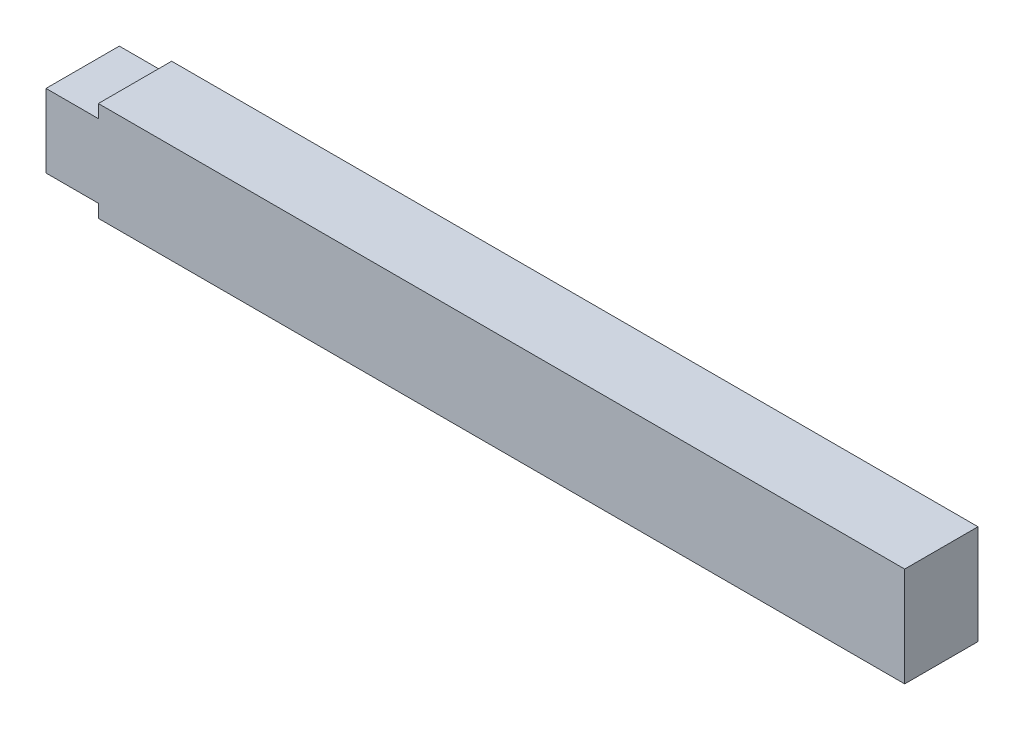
ISO-10303-21;
HEADER;
FILE_DESCRIPTION(('STEP AP214'),'2;1');
FILE_NAME('part.step','',(''),(''),'','','');
FILE_SCHEMA(('AUTOMOTIVE_DESIGN { 1 0 10303 214 1 1 1 1 }'));
ENDSEC;
DATA;
#1=APPLICATION_CONTEXT('core data for automotive mechanical design processes');
#2=APPLICATION_PROTOCOL_DEFINITION('international standard','automotive_design',2000,#1);
#3=PRODUCT_CONTEXT('',#1,'mechanical');
#4=PRODUCT('Part','Part','',(#3));
#5=PRODUCT_RELATED_PRODUCT_CATEGORY('part','',(#4));
#6=PRODUCT_DEFINITION_FORMATION('','',#4);
#7=PRODUCT_DEFINITION_CONTEXT('part definition',#1,'design');
#8=PRODUCT_DEFINITION('design','',#6,#7);
#9=PRODUCT_DEFINITION_SHAPE('','',#8);
#10=(LENGTH_UNIT() NAMED_UNIT(*) SI_UNIT(.MILLI.,.METRE.));
#11=(NAMED_UNIT(*) PLANE_ANGLE_UNIT() SI_UNIT($,.RADIAN.));
#12=(NAMED_UNIT(*) SI_UNIT($,.STERADIAN.) SOLID_ANGLE_UNIT());
#13=UNCERTAINTY_MEASURE_WITH_UNIT(LENGTH_MEASURE(1.E-05),#10,'distance_accuracy_value','');
#14=(GEOMETRIC_REPRESENTATION_CONTEXT(3) GLOBAL_UNCERTAINTY_ASSIGNED_CONTEXT((#13)) GLOBAL_UNIT_ASSIGNED_CONTEXT((#10,
#11,#12)) REPRESENTATION_CONTEXT('',''));
#15=CARTESIAN_POINT('',(0.,0.,0.));
#16=DIRECTION('',(0.,0.,1.));
#17=DIRECTION('',(1.,0.,0.));
#18=AXIS2_PLACEMENT_3D('',#15,#16,#17);
#19=CARTESIAN_POINT('',(-20.,50.,50.));
#20=DIRECTION('',(1.,0.,0.));
#21=DIRECTION('',(0.,1.,0.));
#22=AXIS2_PLACEMENT_3D('',#19,#20,#21);
#23=PLANE('',#22);
#24=DIRECTION('',(0.,-1.,0.));
#25=VECTOR('',#24,1.);
#26=CARTESIAN_POINT('',(-20.,75.,-70.));
#27=LINE('',#26,#25);
#28=CARTESIAN_POINT('',(-20.,95.,-70.));
#29=VERTEX_POINT('',#28);
#30=CARTESIAN_POINT('',(-20.,70.,-70.));
#31=VERTEX_POINT('',#30);
#32=EDGE_CURVE('E192',#29,#31,#27,.T.);
#33=ORIENTED_EDGE('',*,*,#32,.T.);
#34=DIRECTION('',(0.,0.,-1.));
#35=VECTOR('',#34,1.);
#36=CARTESIAN_POINT('',(-20.,70.,50.));
#37=LINE('',#36,#35);
#38=CARTESIAN_POINT('',(-20.,70.,70.));
#39=VERTEX_POINT('',#38);
#40=EDGE_CURVE('E186',#39,#31,#37,.T.);
#41=ORIENTED_EDGE('',*,*,#40,.F.);
#42=DIRECTION('',(0.,-1.,0.));
#43=VECTOR('',#42,1.);
#44=CARTESIAN_POINT('',(-20.,75.,70.));
#45=LINE('',#44,#43);
#46=CARTESIAN_POINT('',(-20.,95.,70.));
#47=VERTEX_POINT('',#46);
#48=EDGE_CURVE('E234',#47,#39,#45,.T.);
#49=ORIENTED_EDGE('',*,*,#48,.F.);
#50=DIRECTION('',(0.,0.,-1.));
#51=VECTOR('',#50,1.);
#52=CARTESIAN_POINT('',(-20.,95.,50.));
#53=LINE('',#52,#51);
#54=EDGE_CURVE('E231',#47,#29,#53,.T.);
#55=ORIENTED_EDGE('',*,*,#54,.T.);
#56=EDGE_LOOP('',(#33,#41,#49,#55));
#57=FACE_BOUND('',#56,.T.);
#58=ADVANCED_FACE('F39',(#57),#23,.F.);
#59=CARTESIAN_POINT('',(0.,70.,50.));
#60=DIRECTION('',(0.,-1.,0.));
#61=DIRECTION('',(0.,0.,-1.));
#62=AXIS2_PLACEMENT_3D('',#59,#60,#61);
#63=PLANE('',#62);
#64=DIRECTION('',(-1.,0.,0.));
#65=VECTOR('',#64,1.);
#66=CARTESIAN_POINT('',(0.,70.,-70.));
#67=LINE('',#66,#65);
#68=CARTESIAN_POINT('',(-120.,70.,-70.));
#69=VERTEX_POINT('',#68);
#70=EDGE_CURVE('E180',#31,#69,#67,.T.);
#71=ORIENTED_EDGE('',*,*,#70,.T.);
#72=DIRECTION('',(0.,0.,-1.));
#73=VECTOR('',#72,1.);
#74=CARTESIAN_POINT('',(-120.,70.,50.));
#75=LINE('',#74,#73);
#76=CARTESIAN_POINT('',(-120.,70.,70.));
#77=VERTEX_POINT('',#76);
#78=EDGE_CURVE('E183',#77,#69,#75,.T.);
#79=ORIENTED_EDGE('',*,*,#78,.F.);
#80=DIRECTION('',(-1.,0.,0.));
#81=VECTOR('',#80,1.);
#82=CARTESIAN_POINT('',(0.,70.,70.));
#83=LINE('',#82,#81);
#84=EDGE_CURVE('E210',#39,#77,#83,.T.);
#85=ORIENTED_EDGE('',*,*,#84,.F.);
#86=ORIENTED_EDGE('',*,*,#40,.T.);
#87=EDGE_LOOP('',(#71,#79,#85,#86));
#88=FACE_BOUND('',#87,.T.);
#89=ADVANCED_FACE('F182',(#88),#63,.F.);
#90=CARTESIAN_POINT('',(-120.,50.,50.));
#91=DIRECTION('',(1.,0.,0.));
#92=DIRECTION('',(0.,0.,-1.));
#93=AXIS2_PLACEMENT_3D('',#90,#91,#92);
#94=PLANE('',#93);
#95=DIRECTION('',(0.,-1.,0.));
#96=VECTOR('',#95,1.);
#97=CARTESIAN_POINT('',(-120.,75.,-70.));
#98=LINE('',#97,#96);
#99=CARTESIAN_POINT('',(-120.,-70.,-70.));
#100=VERTEX_POINT('',#99);
#101=EDGE_CURVE('E191',#69,#100,#98,.T.);
#102=ORIENTED_EDGE('',*,*,#101,.T.);
#103=DIRECTION('',(0.,0.,-1.));
#104=VECTOR('',#103,1.);
#105=CARTESIAN_POINT('',(-120.,-70.,50.));
#106=LINE('',#105,#104);
#107=CARTESIAN_POINT('',(-120.,-70.,70.));
#108=VERTEX_POINT('',#107);
#109=EDGE_CURVE('E199',#108,#100,#106,.T.);
#110=ORIENTED_EDGE('',*,*,#109,.F.);
#111=DIRECTION('',(0.,-1.,0.));
#112=VECTOR('',#111,1.);
#113=CARTESIAN_POINT('',(-120.,75.,70.));
#114=LINE('',#113,#112);
#115=EDGE_CURVE('E198',#77,#108,#114,.T.);
#116=ORIENTED_EDGE('',*,*,#115,.F.);
#117=ORIENTED_EDGE('',*,*,#78,.T.);
#118=EDGE_LOOP('',(#102,#110,#116,#117));
#119=FACE_BOUND('',#118,.T.);
#120=ADVANCED_FACE('F195',(#119),#94,.F.);
#121=CARTESIAN_POINT('',(-100.,-70.,50.));
#122=DIRECTION('',(0.,1.,0.));
#123=DIRECTION('',(-1.,0.,0.));
#124=AXIS2_PLACEMENT_3D('',#121,#122,#123);
#125=PLANE('',#124);
#126=DIRECTION('',(1.,0.,0.));
#127=VECTOR('',#126,1.);
#128=CARTESIAN_POINT('',(0.,-70.,-70.));
#129=LINE('',#128,#127);
#130=CARTESIAN_POINT('',(-20.,-70.,-70.));
#131=VERTEX_POINT('',#130);
#132=EDGE_CURVE('E204',#100,#131,#129,.T.);
#133=ORIENTED_EDGE('',*,*,#132,.T.);
#134=DIRECTION('',(0.,0.,-1.));
#135=VECTOR('',#134,1.);
#136=CARTESIAN_POINT('',(-20.,-70.,50.));
#137=LINE('',#136,#135);
#138=CARTESIAN_POINT('',(-20.,-70.,70.));
#139=VERTEX_POINT('',#138);
#140=EDGE_CURVE('E212',#139,#131,#137,.T.);
#141=ORIENTED_EDGE('',*,*,#140,.F.);
#142=DIRECTION('',(1.,0.,0.));
#143=VECTOR('',#142,1.);
#144=CARTESIAN_POINT('',(0.,-70.,70.));
#145=LINE('',#144,#143);
#146=EDGE_CURVE('E213',#108,#139,#145,.T.);
#147=ORIENTED_EDGE('',*,*,#146,.F.);
#148=ORIENTED_EDGE('',*,*,#109,.T.);
#149=EDGE_LOOP('',(#133,#141,#147,#148));
#150=FACE_BOUND('',#149,.T.);
#151=ADVANCED_FACE('F301',(#150),#125,.F.);
#152=CARTESIAN_POINT('',(-20.,-50.,50.));
#153=DIRECTION('',(1.,0.,0.));
#154=DIRECTION('',(0.,0.,-1.));
#155=AXIS2_PLACEMENT_3D('',#152,#153,#154);
#156=PLANE('',#155);
#157=DIRECTION('',(0.,-1.,0.));
#158=VECTOR('',#157,1.);
#159=CARTESIAN_POINT('',(-20.,75.,-70.));
#160=LINE('',#159,#158);
#161=CARTESIAN_POINT('',(-20.,-95.,-70.));
#162=VERTEX_POINT('',#161);
#163=EDGE_CURVE('E206',#131,#162,#160,.T.);
#164=ORIENTED_EDGE('',*,*,#163,.T.);
#165=DIRECTION('',(0.,0.,-1.));
#166=VECTOR('',#165,1.);
#167=CARTESIAN_POINT('',(-20.,-95.,50.));
#168=LINE('',#167,#166);
#169=CARTESIAN_POINT('',(-20.,-95.,70.));
#170=VERTEX_POINT('',#169);
#171=EDGE_CURVE('E217',#170,#162,#168,.T.);
#172=ORIENTED_EDGE('',*,*,#171,.F.);
#173=DIRECTION('',(0.,-1.,0.));
#174=VECTOR('',#173,1.);
#175=CARTESIAN_POINT('',(-20.,75.,70.));
#176=LINE('',#175,#174);
#177=EDGE_CURVE('E219',#139,#170,#176,.T.);
#178=ORIENTED_EDGE('',*,*,#177,.F.);
#179=ORIENTED_EDGE('',*,*,#140,.T.);
#180=EDGE_LOOP('',(#164,#172,#178,#179));
#181=FACE_BOUND('',#180,.T.);
#182=ADVANCED_FACE('F293',(#181),#156,.F.);
#183=CARTESIAN_POINT('',(1500.,-94.9999999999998,50.));
#184=DIRECTION('',(0.,1.,0.));
#185=DIRECTION('',(-1.,0.,0.));
#186=AXIS2_PLACEMENT_3D('',#183,#184,#185);
#187=PLANE('',#186);
#188=DIRECTION('',(1.,0.,0.));
#189=VECTOR('',#188,1.);
#190=CARTESIAN_POINT('',(0.,-95.,-70.));
#191=LINE('',#190,#189);
#192=CARTESIAN_POINT('',(1520.,-94.9999999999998,-70.));
#193=VERTEX_POINT('',#192);
#194=EDGE_CURVE('E152',#162,#193,#191,.T.);
#195=ORIENTED_EDGE('',*,*,#194,.T.);
#196=DIRECTION('',(0.,0.,-1.));
#197=VECTOR('',#196,1.);
#198=CARTESIAN_POINT('',(1520.,-94.9999999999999,50.));
#199=LINE('',#198,#197);
#200=CARTESIAN_POINT('',(1520.,-94.9999999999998,70.));
#201=VERTEX_POINT('',#200);
#202=EDGE_CURVE('E222',#201,#193,#199,.T.);
#203=ORIENTED_EDGE('',*,*,#202,.F.);
#204=DIRECTION('',(1.,0.,0.));
#205=VECTOR('',#204,1.);
#206=CARTESIAN_POINT('',(0.,-95.,70.));
#207=LINE('',#206,#205);
#208=EDGE_CURVE('E224',#170,#201,#207,.T.);
#209=ORIENTED_EDGE('',*,*,#208,.F.);
#210=ORIENTED_EDGE('',*,*,#171,.T.);
#211=EDGE_LOOP('',(#195,#203,#209,#210));
#212=FACE_BOUND('',#211,.T.);
#213=ADVANCED_FACE('F297',(#212),#187,.F.);
#214=CARTESIAN_POINT('',(1520.,75.,50.));
#215=DIRECTION('',(-1.,0.,0.));
#216=DIRECTION('',(0.,0.,1.));
#217=AXIS2_PLACEMENT_3D('',#214,#215,#216);
#218=PLANE('',#217);
#219=DIRECTION('',(0.,1.,0.));
#220=VECTOR('',#219,1.);
#221=CARTESIAN_POINT('',(1520.,75.,-70.));
#222=LINE('',#221,#220);
#223=CARTESIAN_POINT('',(1520.,95.,-70.));
#224=VERTEX_POINT('',#223);
#225=EDGE_CURVE('E144',#193,#224,#222,.T.);
#226=ORIENTED_EDGE('',*,*,#225,.T.);
#227=DIRECTION('',(0.,0.,-1.));
#228=VECTOR('',#227,1.);
#229=CARTESIAN_POINT('',(1520.,95.,50.));
#230=LINE('',#229,#228);
#231=CARTESIAN_POINT('',(1520.,95.,70.));
#232=VERTEX_POINT('',#231);
#233=EDGE_CURVE('E227',#232,#224,#230,.T.);
#234=ORIENTED_EDGE('',*,*,#233,.F.);
#235=DIRECTION('',(0.,1.,0.));
#236=VECTOR('',#235,1.);
#237=CARTESIAN_POINT('',(1520.,75.,70.));
#238=LINE('',#237,#236);
#239=EDGE_CURVE('E122',#201,#232,#238,.T.);
#240=ORIENTED_EDGE('',*,*,#239,.F.);
#241=ORIENTED_EDGE('',*,*,#202,.T.);
#242=EDGE_LOOP('',(#226,#234,#240,#241));
#243=FACE_BOUND('',#242,.T.);
#244=ADVANCED_FACE('F342',(#243),#218,.F.);
#245=CARTESIAN_POINT('',(0.,95.,50.));
#246=DIRECTION('',(0.,-1.,0.));
#247=DIRECTION('',(0.,0.,-1.));
#248=AXIS2_PLACEMENT_3D('',#245,#246,#247);
#249=PLANE('',#248);
#250=DIRECTION('',(-1.,0.,0.));
#251=VECTOR('',#250,1.);
#252=CARTESIAN_POINT('',(0.,95.,-70.));
#253=LINE('',#252,#251);
#254=EDGE_CURVE('E134',#224,#29,#253,.T.);
#255=ORIENTED_EDGE('',*,*,#254,.T.);
#256=ORIENTED_EDGE('',*,*,#54,.F.);
#257=DIRECTION('',(-1.,0.,0.));
#258=VECTOR('',#257,1.);
#259=CARTESIAN_POINT('',(0.,95.,70.));
#260=LINE('',#259,#258);
#261=EDGE_CURVE('E116',#232,#47,#260,.T.);
#262=ORIENTED_EDGE('',*,*,#261,.F.);
#263=ORIENTED_EDGE('',*,*,#233,.T.);
#264=EDGE_LOOP('',(#255,#256,#262,#263));
#265=FACE_BOUND('',#264,.T.);
#266=ADVANCED_FACE('F351',(#265),#249,.F.);
#267=CARTESIAN_POINT('',(0.,75.,70.));
#268=DIRECTION('',(0.,0.,-1.));
#269=DIRECTION('',(-1.,0.,0.));
#270=AXIS2_PLACEMENT_3D('',#267,#268,#269);
#271=PLANE('',#270);
#272=ORIENTED_EDGE('',*,*,#48,.T.);
#273=ORIENTED_EDGE('',*,*,#84,.T.);
#274=ORIENTED_EDGE('',*,*,#115,.T.);
#275=ORIENTED_EDGE('',*,*,#146,.T.);
#276=ORIENTED_EDGE('',*,*,#177,.T.);
#277=ORIENTED_EDGE('',*,*,#208,.T.);
#278=ORIENTED_EDGE('',*,*,#239,.T.);
#279=ORIENTED_EDGE('',*,*,#261,.T.);
#280=EDGE_LOOP('',(#272,#273,#274,#275,#276,#277,#278,#279));
#281=FACE_BOUND('',#280,.T.);
#282=ADVANCED_FACE('F298',(#281),#271,.F.);
#283=CARTESIAN_POINT('',(0.,75.,-70.));
#284=DIRECTION('',(0.,0.,-1.));
#285=DIRECTION('',(-1.,0.,0.));
#286=AXIS2_PLACEMENT_3D('',#283,#284,#285);
#287=PLANE('',#286);
#288=ORIENTED_EDGE('',*,*,#32,.F.);
#289=ORIENTED_EDGE('',*,*,#254,.F.);
#290=ORIENTED_EDGE('',*,*,#225,.F.);
#291=ORIENTED_EDGE('',*,*,#194,.F.);
#292=ORIENTED_EDGE('',*,*,#163,.F.);
#293=ORIENTED_EDGE('',*,*,#132,.F.);
#294=ORIENTED_EDGE('',*,*,#101,.F.);
#295=ORIENTED_EDGE('',*,*,#70,.F.);
#296=EDGE_LOOP('',(#288,#289,#290,#291,#292,#293,#294,#295));
#297=FACE_BOUND('',#296,.T.);
#298=ADVANCED_FACE('F202',(#297),#287,.T.);
#299=CLOSED_SHELL('',(#58,#89,#120,#151,#182,#213,#244,#266,#282,#298));
#300=CARTESIAN_POINT('',(0.,50.,50.));
#301=DIRECTION('',(1.,0.,0.));
#302=DIRECTION('',(0.,1.,0.));
#303=AXIS2_PLACEMENT_3D('',#300,#301,#302);
#304=PLANE('',#303);
#305=DIRECTION('',(0.,-1.,0.));
#306=VECTOR('',#305,1.);
#307=CARTESIAN_POINT('',(0.,50.,-50.));
#308=LINE('',#307,#306);
#309=CARTESIAN_POINT('',(0.,75.,-50.));
#310=VERTEX_POINT('',#309);
#311=CARTESIAN_POINT('',(0.,50.,-50.));
#312=VERTEX_POINT('',#311);
#313=EDGE_CURVE('E43',#310,#312,#308,.T.);
#314=ORIENTED_EDGE('',*,*,#313,.F.);
#315=DIRECTION('',(0.,0.,-1.));
#316=VECTOR('',#315,1.);
#317=CARTESIAN_POINT('',(0.,75.,50.));
#318=LINE('',#317,#316);
#319=CARTESIAN_POINT('',(0.,75.,50.));
#320=VERTEX_POINT('',#319);
#321=EDGE_CURVE('E279',#320,#310,#318,.T.);
#322=ORIENTED_EDGE('',*,*,#321,.F.);
#323=DIRECTION('',(0.,-1.,0.));
#324=VECTOR('',#323,1.);
#325=CARTESIAN_POINT('',(0.,50.,50.));
#326=LINE('',#325,#324);
#327=CARTESIAN_POINT('',(0.,50.,50.));
#328=VERTEX_POINT('',#327);
#329=EDGE_CURVE('E246',#320,#328,#326,.T.);
#330=ORIENTED_EDGE('',*,*,#329,.T.);
#331=DIRECTION('',(0.,0.,-1.));
#332=VECTOR('',#331,1.);
#333=CARTESIAN_POINT('',(0.,50.,50.));
#334=LINE('',#333,#332);
#335=EDGE_CURVE('E277',#328,#312,#334,.T.);
#336=ORIENTED_EDGE('',*,*,#335,.T.);
#337=EDGE_LOOP('',(#314,#322,#330,#336));
#338=FACE_BOUND('',#337,.T.);
#339=ADVANCED_FACE('F383',(#338),#304,.T.);
#340=CARTESIAN_POINT('',(0.,50.,50.));
#341=DIRECTION('',(0.,-1.,0.));
#342=DIRECTION('',(0.,0.,-1.));
#343=AXIS2_PLACEMENT_3D('',#340,#341,#342);
#344=PLANE('',#343);
#345=DIRECTION('',(-1.,0.,0.));
#346=VECTOR('',#345,1.);
#347=CARTESIAN_POINT('',(0.,50.,-50.));
#348=LINE('',#347,#346);
#349=CARTESIAN_POINT('',(-100.,50.,-50.));
#350=VERTEX_POINT('',#349);
#351=EDGE_CURVE('E59',#312,#350,#348,.T.);
#352=ORIENTED_EDGE('',*,*,#351,.F.);
#353=ORIENTED_EDGE('',*,*,#335,.F.);
#354=DIRECTION('',(-1.,0.,0.));
#355=VECTOR('',#354,1.);
#356=CARTESIAN_POINT('',(0.,50.,50.));
#357=LINE('',#356,#355);
#358=CARTESIAN_POINT('',(-100.,50.,50.));
#359=VERTEX_POINT('',#358);
#360=EDGE_CURVE('E106',#328,#359,#357,.T.);
#361=ORIENTED_EDGE('',*,*,#360,.T.);
#362=DIRECTION('',(0.,0.,-1.));
#363=VECTOR('',#362,1.);
#364=CARTESIAN_POINT('',(-100.,50.,50.));
#365=LINE('',#364,#363);
#366=EDGE_CURVE('E273',#359,#350,#365,.T.);
#367=ORIENTED_EDGE('',*,*,#366,.T.);
#368=EDGE_LOOP('',(#352,#353,#361,#367));
#369=FACE_BOUND('',#368,.T.);
#370=ADVANCED_FACE('F388',(#369),#344,.T.);
#371=CARTESIAN_POINT('',(-100.,50.,50.));
#372=DIRECTION('',(1.,0.,0.));
#373=DIRECTION('',(0.,0.,-1.));
#374=AXIS2_PLACEMENT_3D('',#371,#372,#373);
#375=PLANE('',#374);
#376=DIRECTION('',(0.,-1.,0.));
#377=VECTOR('',#376,1.);
#378=CARTESIAN_POINT('',(-100.,50.,-50.));
#379=LINE('',#378,#377);
#380=CARTESIAN_POINT('',(-100.,-50.,-50.));
#381=VERTEX_POINT('',#380);
#382=EDGE_CURVE('E275',#350,#381,#379,.T.);
#383=ORIENTED_EDGE('',*,*,#382,.F.);
#384=ORIENTED_EDGE('',*,*,#366,.F.);
#385=DIRECTION('',(0.,-1.,0.));
#386=VECTOR('',#385,1.);
#387=CARTESIAN_POINT('',(-100.,50.,50.));
#388=LINE('',#387,#386);
#389=CARTESIAN_POINT('',(-100.,-50.,50.));
#390=VERTEX_POINT('',#389);
#391=EDGE_CURVE('E243',#359,#390,#388,.T.);
#392=ORIENTED_EDGE('',*,*,#391,.T.);
#393=DIRECTION('',(0.,0.,-1.));
#394=VECTOR('',#393,1.);
#395=CARTESIAN_POINT('',(-100.,-50.,50.));
#396=LINE('',#395,#394);
#397=EDGE_CURVE('E268',#390,#381,#396,.T.);
#398=ORIENTED_EDGE('',*,*,#397,.T.);
#399=EDGE_LOOP('',(#383,#384,#392,#398));
#400=FACE_BOUND('',#399,.T.);
#401=ADVANCED_FACE('F401',(#400),#375,.T.);
#402=CARTESIAN_POINT('',(-100.,-50.,50.));
#403=DIRECTION('',(0.,1.,0.));
#404=DIRECTION('',(-1.,0.,0.));
#405=AXIS2_PLACEMENT_3D('',#402,#403,#404);
#406=PLANE('',#405);
#407=DIRECTION('',(1.,0.,0.));
#408=VECTOR('',#407,1.);
#409=CARTESIAN_POINT('',(-100.,-50.,-50.));
#410=LINE('',#409,#408);
#411=CARTESIAN_POINT('',(0.,-50.,-50.));
#412=VERTEX_POINT('',#411);
#413=EDGE_CURVE('E271',#381,#412,#410,.T.);
#414=ORIENTED_EDGE('',*,*,#413,.F.);
#415=ORIENTED_EDGE('',*,*,#397,.F.);
#416=DIRECTION('',(1.,0.,0.));
#417=VECTOR('',#416,1.);
#418=CARTESIAN_POINT('',(-100.,-50.,50.));
#419=LINE('',#418,#417);
#420=CARTESIAN_POINT('',(0.,-50.,50.));
#421=VERTEX_POINT('',#420);
#422=EDGE_CURVE('E241',#390,#421,#419,.T.);
#423=ORIENTED_EDGE('',*,*,#422,.T.);
#424=DIRECTION('',(0.,0.,-1.));
#425=VECTOR('',#424,1.);
#426=CARTESIAN_POINT('',(0.,-50.,50.));
#427=LINE('',#426,#425);
#428=EDGE_CURVE('E263',#421,#412,#427,.T.);
#429=ORIENTED_EDGE('',*,*,#428,.T.);
#430=EDGE_LOOP('',(#414,#415,#423,#429));
#431=FACE_BOUND('',#430,.T.);
#432=ADVANCED_FACE('F411',(#431),#406,.T.);
#433=CARTESIAN_POINT('',(0.,-50.,50.));
#434=DIRECTION('',(1.,0.,0.));
#435=DIRECTION('',(0.,0.,-1.));
#436=AXIS2_PLACEMENT_3D('',#433,#434,#435);
#437=PLANE('',#436);
#438=DIRECTION('',(0.,-1.,0.));
#439=VECTOR('',#438,1.);
#440=CARTESIAN_POINT('',(0.,-50.,-50.));
#441=LINE('',#440,#439);
#442=CARTESIAN_POINT('',(0.,-75.,-50.));
#443=VERTEX_POINT('',#442);
#444=EDGE_CURVE('E266',#412,#443,#441,.T.);
#445=ORIENTED_EDGE('',*,*,#444,.F.);
#446=ORIENTED_EDGE('',*,*,#428,.F.);
#447=DIRECTION('',(0.,-1.,0.));
#448=VECTOR('',#447,1.);
#449=CARTESIAN_POINT('',(0.,-50.,50.));
#450=LINE('',#449,#448);
#451=CARTESIAN_POINT('',(0.,-75.,50.));
#452=VERTEX_POINT('',#451);
#453=EDGE_CURVE('E239',#421,#452,#450,.T.);
#454=ORIENTED_EDGE('',*,*,#453,.T.);
#455=DIRECTION('',(0.,0.,-1.));
#456=VECTOR('',#455,1.);
#457=CARTESIAN_POINT('',(0.,-75.,50.));
#458=LINE('',#457,#456);
#459=EDGE_CURVE('E258',#452,#443,#458,.T.);
#460=ORIENTED_EDGE('',*,*,#459,.T.);
#461=EDGE_LOOP('',(#445,#446,#454,#460));
#462=FACE_BOUND('',#461,.T.);
#463=ADVANCED_FACE('F422',(#462),#437,.T.);
#464=CARTESIAN_POINT('',(1500.,-74.9999999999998,50.));
#465=DIRECTION('',(0.,1.,0.));
#466=DIRECTION('',(-1.,0.,0.));
#467=AXIS2_PLACEMENT_3D('',#464,#465,#466);
#468=PLANE('',#467);
#469=DIRECTION('',(1.,0.,0.));
#470=VECTOR('',#469,1.);
#471=CARTESIAN_POINT('',(1500.,-74.9999999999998,-50.));
#472=LINE('',#471,#470);
#473=CARTESIAN_POINT('',(1500.,-74.9999999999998,-50.));
#474=VERTEX_POINT('',#473);
#475=EDGE_CURVE('E261',#443,#474,#472,.T.);
#476=ORIENTED_EDGE('',*,*,#475,.F.);
#477=ORIENTED_EDGE('',*,*,#459,.F.);
#478=DIRECTION('',(1.,0.,0.));
#479=VECTOR('',#478,1.);
#480=CARTESIAN_POINT('',(1500.,-74.9999999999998,50.));
#481=LINE('',#480,#479);
#482=CARTESIAN_POINT('',(1500.,-74.9999999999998,50.));
#483=VERTEX_POINT('',#482);
#484=EDGE_CURVE('E237',#452,#483,#481,.T.);
#485=ORIENTED_EDGE('',*,*,#484,.T.);
#486=DIRECTION('',(0.,0.,-1.));
#487=VECTOR('',#486,1.);
#488=CARTESIAN_POINT('',(1500.,-74.9999999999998,50.));
#489=LINE('',#488,#487);
#490=EDGE_CURVE('E253',#483,#474,#489,.T.);
#491=ORIENTED_EDGE('',*,*,#490,.T.);
#492=EDGE_LOOP('',(#476,#477,#485,#491));
#493=FACE_BOUND('',#492,.T.);
#494=ADVANCED_FACE('F433',(#493),#468,.T.);
#495=CARTESIAN_POINT('',(1500.,75.,50.));
#496=DIRECTION('',(-1.,0.,0.));
#497=DIRECTION('',(0.,0.,1.));
#498=AXIS2_PLACEMENT_3D('',#495,#496,#497);
#499=PLANE('',#498);
#500=DIRECTION('',(0.,1.,0.));
#501=VECTOR('',#500,1.);
#502=CARTESIAN_POINT('',(1500.,75.,-50.));
#503=LINE('',#502,#501);
#504=CARTESIAN_POINT('',(1500.,75.,-50.));
#505=VERTEX_POINT('',#504);
#506=EDGE_CURVE('E256',#474,#505,#503,.T.);
#507=ORIENTED_EDGE('',*,*,#506,.F.);
#508=ORIENTED_EDGE('',*,*,#490,.F.);
#509=DIRECTION('',(0.,1.,0.));
#510=VECTOR('',#509,1.);
#511=CARTESIAN_POINT('',(1500.,75.,50.));
#512=LINE('',#511,#510);
#513=CARTESIAN_POINT('',(1500.,75.,50.));
#514=VERTEX_POINT('',#513);
#515=EDGE_CURVE('E50',#483,#514,#512,.T.);
#516=ORIENTED_EDGE('',*,*,#515,.T.);
#517=DIRECTION('',(0.,0.,-1.));
#518=VECTOR('',#517,1.);
#519=CARTESIAN_POINT('',(1500.,75.,50.));
#520=LINE('',#519,#518);
#521=EDGE_CURVE('E248',#514,#505,#520,.T.);
#522=ORIENTED_EDGE('',*,*,#521,.T.);
#523=EDGE_LOOP('',(#507,#508,#516,#522));
#524=FACE_BOUND('',#523,.T.);
#525=ADVANCED_FACE('F444',(#524),#499,.T.);
#526=CARTESIAN_POINT('',(0.,75.,50.));
#527=DIRECTION('',(0.,-1.,0.));
#528=DIRECTION('',(0.,0.,-1.));
#529=AXIS2_PLACEMENT_3D('',#526,#527,#528);
#530=PLANE('',#529);
#531=DIRECTION('',(-1.,0.,0.));
#532=VECTOR('',#531,1.);
#533=CARTESIAN_POINT('',(0.,75.,-50.));
#534=LINE('',#533,#532);
#535=EDGE_CURVE('E251',#505,#310,#534,.T.);
#536=ORIENTED_EDGE('',*,*,#535,.F.);
#537=ORIENTED_EDGE('',*,*,#521,.F.);
#538=DIRECTION('',(-1.,0.,0.));
#539=VECTOR('',#538,1.);
#540=CARTESIAN_POINT('',(0.,75.,50.));
#541=LINE('',#540,#539);
#542=EDGE_CURVE('E11',#514,#320,#541,.T.);
#543=ORIENTED_EDGE('',*,*,#542,.T.);
#544=ORIENTED_EDGE('',*,*,#321,.T.);
#545=EDGE_LOOP('',(#536,#537,#543,#544));
#546=FACE_BOUND('',#545,.T.);
#547=ADVANCED_FACE('F455',(#546),#530,.T.);
#548=CARTESIAN_POINT('',(0.,75.,50.));
#549=DIRECTION('',(0.,0.,-1.));
#550=DIRECTION('',(-1.,0.,0.));
#551=AXIS2_PLACEMENT_3D('',#548,#549,#550);
#552=PLANE('',#551);
#553=ORIENTED_EDGE('',*,*,#329,.F.);
#554=ORIENTED_EDGE('',*,*,#542,.F.);
#555=ORIENTED_EDGE('',*,*,#515,.F.);
#556=ORIENTED_EDGE('',*,*,#484,.F.);
#557=ORIENTED_EDGE('',*,*,#453,.F.);
#558=ORIENTED_EDGE('',*,*,#422,.F.);
#559=ORIENTED_EDGE('',*,*,#391,.F.);
#560=ORIENTED_EDGE('',*,*,#360,.F.);
#561=EDGE_LOOP('',(#553,#554,#555,#556,#557,#558,#559,#560));
#562=FACE_BOUND('',#561,.T.);
#563=ADVANCED_FACE('F466',(#562),#552,.T.);
#564=CARTESIAN_POINT('',(0.,75.,-50.));
#565=DIRECTION('',(0.,0.,-1.));
#566=DIRECTION('',(-1.,0.,0.));
#567=AXIS2_PLACEMENT_3D('',#564,#565,#566);
#568=PLANE('',#567);
#569=ORIENTED_EDGE('',*,*,#313,.T.);
#570=ORIENTED_EDGE('',*,*,#351,.T.);
#571=ORIENTED_EDGE('',*,*,#382,.T.);
#572=ORIENTED_EDGE('',*,*,#413,.T.);
#573=ORIENTED_EDGE('',*,*,#444,.T.);
#574=ORIENTED_EDGE('',*,*,#475,.T.);
#575=ORIENTED_EDGE('',*,*,#506,.T.);
#576=ORIENTED_EDGE('',*,*,#535,.T.);
#577=EDGE_LOOP('',(#569,#570,#571,#572,#573,#574,#575,#576));
#578=FACE_BOUND('',#577,.T.);
#579=ADVANCED_FACE('F41',(#578),#568,.F.);
#580=CLOSED_SHELL('',(#339,#370,#401,#432,#463,#494,#525,#547,#563,#579));
#581=ORIENTED_CLOSED_SHELL('',*,#580,.T.);
#582=BREP_WITH_VOIDS('B2',#299,(#581));
#583=ADVANCED_BREP_SHAPE_REPRESENTATION('',(#18,#582),#14);
#584=SHAPE_DEFINITION_REPRESENTATION(#9,#583);
ENDSEC;
END-ISO-10303-21;
